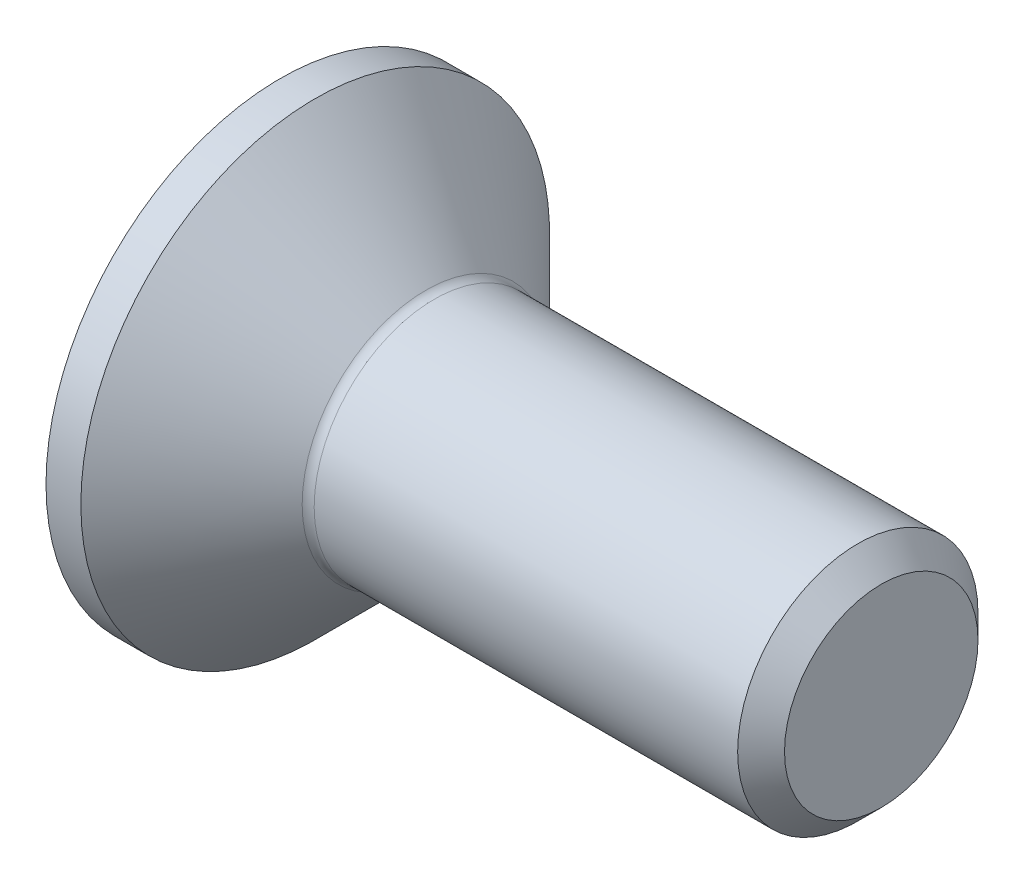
ISO-10303-21;
HEADER;
FILE_DESCRIPTION(('STEP AP214'),'2;1');
FILE_NAME('part.step','',(''),(''),'','','');
FILE_SCHEMA(('AUTOMOTIVE_DESIGN { 1 0 10303 214 1 1 1 1 }'));
ENDSEC;
DATA;
#1=APPLICATION_CONTEXT('core data for automotive mechanical design processes');
#2=APPLICATION_PROTOCOL_DEFINITION('international standard','automotive_design',2000,#1);
#3=PRODUCT_CONTEXT('',#1,'mechanical');
#4=PRODUCT('Part','Part','',(#3));
#5=PRODUCT_RELATED_PRODUCT_CATEGORY('part','',(#4));
#6=PRODUCT_DEFINITION_FORMATION('','',#4);
#7=PRODUCT_DEFINITION_CONTEXT('part definition',#1,'design');
#8=PRODUCT_DEFINITION('design','',#6,#7);
#9=PRODUCT_DEFINITION_SHAPE('','',#8);
#10=(LENGTH_UNIT() NAMED_UNIT(*) SI_UNIT(.MILLI.,.METRE.));
#11=(NAMED_UNIT(*) PLANE_ANGLE_UNIT() SI_UNIT($,.RADIAN.));
#12=(NAMED_UNIT(*) SI_UNIT($,.STERADIAN.) SOLID_ANGLE_UNIT());
#13=UNCERTAINTY_MEASURE_WITH_UNIT(LENGTH_MEASURE(1.E-05),#10,'distance_accuracy_value','');
#14=(GEOMETRIC_REPRESENTATION_CONTEXT(3) GLOBAL_UNCERTAINTY_ASSIGNED_CONTEXT((#13)) GLOBAL_UNIT_ASSIGNED_CONTEXT((#10,
#11,#12)) REPRESENTATION_CONTEXT('',''));
#15=CARTESIAN_POINT('',(0.,0.,0.));
#16=DIRECTION('',(0.,0.,1.));
#17=DIRECTION('',(1.,0.,0.));
#18=AXIS2_PLACEMENT_3D('',#15,#16,#17);
#19=CARTESIAN_POINT('',(0.,0.,0.));
#20=DIRECTION('',(-1.,0.,0.));
#21=DIRECTION('',(0.,0.,1.));
#22=AXIS2_PLACEMENT_3D('',#19,#20,#21);
#23=PLANE('',#22);
#24=CARTESIAN_POINT('',(0.,0.,0.));
#25=DIRECTION('',(-1.,0.,0.));
#26=DIRECTION('',(0.,0.,1.));
#27=AXIS2_PLACEMENT_3D('',#24,#25,#26);
#28=CIRCLE('',#27,3.9);
#29=CARTESIAN_POINT('',(0.,0.,3.9));
#30=VERTEX_POINT('',#29);
#31=EDGE_CURVE('E155',#30,#30,#28,.T.);
#32=ORIENTED_EDGE('',*,*,#31,.T.);
#33=EDGE_LOOP('',(#32));
#34=FACE_BOUND('',#33,.T.);
#35=DIRECTION('',(0.,-0.5,-0.866025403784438));
#36=VECTOR('',#35,1.);
#37=CARTESIAN_POINT('',(0.,-0.721687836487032,1.25));
#38=LINE('',#37,#36);
#39=CARTESIAN_POINT('',(0.,-0.721687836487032,1.25));
#40=VERTEX_POINT('',#39);
#41=CARTESIAN_POINT('',(0.,-1.44337567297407,0.));
#42=VERTEX_POINT('',#41);
#43=EDGE_CURVE('E117',#40,#42,#38,.T.);
#44=ORIENTED_EDGE('',*,*,#43,.T.);
#45=DIRECTION('',(0.,0.5,-0.866025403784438));
#46=VECTOR('',#45,1.);
#47=CARTESIAN_POINT('',(0.,-1.44337567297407,0.));
#48=LINE('',#47,#46);
#49=CARTESIAN_POINT('',(0.,-0.721687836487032,-1.25));
#50=VERTEX_POINT('',#49);
#51=EDGE_CURVE('E47',#42,#50,#48,.T.);
#52=ORIENTED_EDGE('',*,*,#51,.T.);
#53=DIRECTION('',(0.,1.,0.));
#54=VECTOR('',#53,1.);
#55=CARTESIAN_POINT('',(0.,-0.721687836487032,-1.25));
#56=LINE('',#55,#54);
#57=CARTESIAN_POINT('',(0.,0.721687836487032,-1.25));
#58=VERTEX_POINT('',#57);
#59=EDGE_CURVE('E132',#50,#58,#56,.T.);
#60=ORIENTED_EDGE('',*,*,#59,.T.);
#61=DIRECTION('',(0.,0.5,0.866025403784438));
#62=VECTOR('',#61,1.);
#63=CARTESIAN_POINT('',(0.,0.721687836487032,-1.25));
#64=LINE('',#63,#62);
#65=CARTESIAN_POINT('',(0.,1.44337567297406,0.));
#66=VERTEX_POINT('',#65);
#67=EDGE_CURVE('E268',#58,#66,#64,.T.);
#68=ORIENTED_EDGE('',*,*,#67,.T.);
#69=DIRECTION('',(0.,-0.5,0.866025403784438));
#70=VECTOR('',#69,1.);
#71=CARTESIAN_POINT('',(0.,1.44337567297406,0.));
#72=LINE('',#71,#70);
#73=CARTESIAN_POINT('',(0.,0.721687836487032,1.25));
#74=VERTEX_POINT('',#73);
#75=EDGE_CURVE('E271',#66,#74,#72,.T.);
#76=ORIENTED_EDGE('',*,*,#75,.T.);
#77=DIRECTION('',(0.,-1.,0.));
#78=VECTOR('',#77,1.);
#79=CARTESIAN_POINT('',(0.,0.721687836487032,1.25));
#80=LINE('',#79,#78);
#81=EDGE_CURVE('E274',#74,#40,#80,.T.);
#82=ORIENTED_EDGE('',*,*,#81,.T.);
#83=EDGE_LOOP('',(#44,#52,#60,#68,#76,#82));
#84=FACE_BOUND('',#83,.T.);
#85=ADVANCED_FACE('F32',(#34,#84),#23,.T.);
#86=CARTESIAN_POINT('',(0.,0.,0.));
#87=DIRECTION('',(-1.,0.,0.));
#88=DIRECTION('',(0.,0.,1.));
#89=AXIS2_PLACEMENT_3D('',#86,#87,#88);
#90=CYLINDRICAL_SURFACE('',#89,3.9);
#91=CARTESIAN_POINT('',(0.580000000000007,0.,0.));
#92=DIRECTION('',(-1.,0.,0.));
#93=DIRECTION('',(0.,0.,1.));
#94=AXIS2_PLACEMENT_3D('',#91,#92,#93);
#95=CIRCLE('',#94,3.9);
#96=CARTESIAN_POINT('',(0.580000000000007,0.,3.9));
#97=VERTEX_POINT('',#96);
#98=EDGE_CURVE('E152',#97,#97,#95,.T.);
#99=ORIENTED_EDGE('',*,*,#98,.T.);
#100=EDGE_LOOP('',(#99));
#101=FACE_BOUND('',#100,.T.);
#102=ORIENTED_EDGE('',*,*,#31,.F.);
#103=EDGE_LOOP('',(#102));
#104=FACE_BOUND('',#103,.T.);
#105=ADVANCED_FACE('F176',(#101,#104),#90,.T.);
#106=CARTESIAN_POINT('',(0.580000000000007,0.,0.));
#107=DIRECTION('',(-1.,0.,0.));
#108=DIRECTION('',(0.,0.,1.));
#109=AXIS2_PLACEMENT_3D('',#106,#107,#108);
#110=CONICAL_SURFACE('',#109,3.9,0.78539816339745);
#111=CARTESIAN_POINT('',(2.42142135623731,0.,0.));
#112=DIRECTION('',(-1.,0.,0.));
#113=DIRECTION('',(0.,0.,1.));
#114=AXIS2_PLACEMENT_3D('',#111,#112,#113);
#115=CIRCLE('',#114,2.05857864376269);
#116=CARTESIAN_POINT('',(2.42142135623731,0.,2.05857864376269));
#117=VERTEX_POINT('',#116);
#118=EDGE_CURVE('E40',#117,#117,#115,.T.);
#119=ORIENTED_EDGE('',*,*,#118,.T.);
#120=EDGE_LOOP('',(#119));
#121=FACE_BOUND('',#120,.T.);
#122=ORIENTED_EDGE('',*,*,#98,.F.);
#123=EDGE_LOOP('',(#122));
#124=FACE_BOUND('',#123,.T.);
#125=ADVANCED_FACE('F160',(#121,#124),#110,.T.);
#126=CARTESIAN_POINT('',(0.,0.,0.));
#127=DIRECTION('',(-1.,0.,0.));
#128=DIRECTION('',(0.,0.,1.));
#129=AXIS2_PLACEMENT_3D('',#126,#127,#128);
#130=CYLINDRICAL_SURFACE('',#129,1.99999999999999);
#131=CARTESIAN_POINT('',(2.56284271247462,0.,0.));
#132=DIRECTION('',(-1.,0.,0.));
#133=DIRECTION('',(0.,0.,1.));
#134=AXIS2_PLACEMENT_3D('',#131,#132,#133);
#135=CIRCLE('',#134,1.99999999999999);
#136=CARTESIAN_POINT('',(2.56284271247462,0.,1.99999999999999));
#137=VERTEX_POINT('',#136);
#138=EDGE_CURVE('E11',#137,#137,#135,.F.);
#139=ORIENTED_EDGE('',*,*,#138,.T.);
#140=EDGE_LOOP('',(#139));
#141=FACE_BOUND('',#140,.T.);
#142=CARTESIAN_POINT('',(9.61,0.,0.));
#143=DIRECTION('',(-1.,0.,0.));
#144=DIRECTION('',(0.,0.,1.));
#145=AXIS2_PLACEMENT_3D('',#142,#143,#144);
#146=CIRCLE('',#145,1.99999999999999);
#147=CARTESIAN_POINT('',(9.61,0.,1.99999999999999));
#148=VERTEX_POINT('',#147);
#149=EDGE_CURVE('E149',#148,#148,#146,.T.);
#150=ORIENTED_EDGE('',*,*,#149,.T.);
#151=EDGE_LOOP('',(#150));
#152=FACE_BOUND('',#151,.T.);
#153=ADVANCED_FACE('F187',(#141,#152),#130,.T.);
#154=CARTESIAN_POINT('',(10.,0.,0.));
#155=DIRECTION('',(-1.,0.,0.));
#156=DIRECTION('',(0.,0.,1.));
#157=AXIS2_PLACEMENT_3D('',#154,#155,#156);
#158=CONICAL_SURFACE('',#157,1.61,0.785398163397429);
#159=ORIENTED_EDGE('',*,*,#149,.F.);
#160=EDGE_LOOP('',(#159));
#161=FACE_BOUND('',#160,.T.);
#162=CARTESIAN_POINT('',(10.,0.,0.));
#163=DIRECTION('',(-1.,0.,0.));
#164=DIRECTION('',(0.,0.,1.));
#165=AXIS2_PLACEMENT_3D('',#162,#163,#164);
#166=CIRCLE('',#165,1.61);
#167=CARTESIAN_POINT('',(10.,0.,1.61));
#168=VERTEX_POINT('',#167);
#169=EDGE_CURVE('E145',#168,#168,#166,.T.);
#170=ORIENTED_EDGE('',*,*,#169,.T.);
#171=EDGE_LOOP('',(#170));
#172=FACE_BOUND('',#171,.T.);
#173=ADVANCED_FACE('F171',(#161,#172),#158,.T.);
#174=CARTESIAN_POINT('',(10.,1.61,0.));
#175=DIRECTION('',(1.,0.,0.));
#176=DIRECTION('',(0.,0.,-1.));
#177=AXIS2_PLACEMENT_3D('',#174,#175,#176);
#178=PLANE('',#177);
#179=ORIENTED_EDGE('',*,*,#169,.F.);
#180=EDGE_LOOP('',(#179));
#181=FACE_BOUND('',#180,.T.);
#182=ADVANCED_FACE('F164',(#181),#178,.T.);
#183=CARTESIAN_POINT('',(2.56284271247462,0.,0.));
#184=DIRECTION('',(-1.,0.,0.));
#185=DIRECTION('',(0.,0.,1.));
#186=AXIS2_PLACEMENT_3D('',#183,#184,#185);
#187=TOROIDAL_SURFACE('',#186,2.19999999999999,0.2);
#188=ORIENTED_EDGE('',*,*,#138,.F.);
#189=EDGE_LOOP('',(#188));
#190=FACE_BOUND('',#189,.T.);
#191=ORIENTED_EDGE('',*,*,#118,.F.);
#192=EDGE_LOOP('',(#191));
#193=FACE_BOUND('',#192,.T.);
#194=ADVANCED_FACE('F34',(#190,#193),#187,.F.);
#195=CARTESIAN_POINT('',(1.5,-1.44337567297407,0.));
#196=DIRECTION('',(0.,0.866025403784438,0.5));
#197=DIRECTION('',(0.,-0.5,0.866025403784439));
#198=AXIS2_PLACEMENT_3D('',#195,#196,#197);
#199=PLANE('',#198);
#200=ORIENTED_EDGE('',*,*,#51,.F.);
#201=DIRECTION('',(-1.,0.,0.));
#202=VECTOR('',#201,1.);
#203=CARTESIAN_POINT('',(1.5,-1.44337567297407,0.));
#204=LINE('',#203,#202);
#205=CARTESIAN_POINT('',(1.5,-1.44337567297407,0.));
#206=VERTEX_POINT('',#205);
#207=EDGE_CURVE('E265',#206,#42,#204,.T.);
#208=ORIENTED_EDGE('',*,*,#207,.F.);
#209=DIRECTION('',(0.,0.5,-0.866025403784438));
#210=VECTOR('',#209,1.);
#211=CARTESIAN_POINT('',(1.5,-1.44337567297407,0.));
#212=LINE('',#211,#210);
#213=CARTESIAN_POINT('',(1.5,-1.08253175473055,-0.625000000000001));
#214=VERTEX_POINT('',#213);
#215=EDGE_CURVE('E114',#206,#214,#212,.T.);
#216=ORIENTED_EDGE('',*,*,#215,.T.);
#217=CARTESIAN_POINT('',(1.5,-0.721687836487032,-1.25));
#218=VERTEX_POINT('',#217);
#219=EDGE_CURVE('E108',#214,#218,#212,.T.);
#220=ORIENTED_EDGE('',*,*,#219,.T.);
#221=DIRECTION('',(-1.,0.,0.));
#222=VECTOR('',#221,1.);
#223=CARTESIAN_POINT('',(1.5,-0.721687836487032,-1.25));
#224=LINE('',#223,#222);
#225=EDGE_CURVE('E112',#218,#50,#224,.T.);
#226=ORIENTED_EDGE('',*,*,#225,.T.);
#227=EDGE_LOOP('',(#200,#208,#216,#220,#226));
#228=FACE_BOUND('',#227,.T.);
#229=ADVANCED_FACE('F110',(#228),#199,.T.);
#230=CARTESIAN_POINT('',(1.5,-0.721687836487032,-1.25));
#231=DIRECTION('',(0.,0.,1.));
#232=DIRECTION('',(0.,-1.,0.));
#233=AXIS2_PLACEMENT_3D('',#230,#231,#232);
#234=PLANE('',#233);
#235=ORIENTED_EDGE('',*,*,#59,.F.);
#236=ORIENTED_EDGE('',*,*,#225,.F.);
#237=DIRECTION('',(0.,1.,0.));
#238=VECTOR('',#237,1.);
#239=CARTESIAN_POINT('',(1.5,-0.721687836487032,-1.25));
#240=LINE('',#239,#238);
#241=CARTESIAN_POINT('',(1.5,0.,-1.25));
#242=VERTEX_POINT('',#241);
#243=EDGE_CURVE('E120',#218,#242,#240,.T.);
#244=ORIENTED_EDGE('',*,*,#243,.T.);
#245=CARTESIAN_POINT('',(1.5,0.721687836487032,-1.25));
#246=VERTEX_POINT('',#245);
#247=EDGE_CURVE('E127',#242,#246,#240,.T.);
#248=ORIENTED_EDGE('',*,*,#247,.T.);
#249=DIRECTION('',(-1.,0.,0.));
#250=VECTOR('',#249,1.);
#251=CARTESIAN_POINT('',(1.5,0.721687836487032,-1.25));
#252=LINE('',#251,#250);
#253=EDGE_CURVE('E134',#246,#58,#252,.T.);
#254=ORIENTED_EDGE('',*,*,#253,.T.);
#255=EDGE_LOOP('',(#235,#236,#244,#248,#254));
#256=FACE_BOUND('',#255,.T.);
#257=ADVANCED_FACE('F129',(#256),#234,.T.);
#258=CARTESIAN_POINT('',(1.5,0.721687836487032,-1.25));
#259=DIRECTION('',(0.,-0.866025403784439,0.5));
#260=DIRECTION('',(0.,-0.5,-0.866025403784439));
#261=AXIS2_PLACEMENT_3D('',#258,#259,#260);
#262=PLANE('',#261);
#263=ORIENTED_EDGE('',*,*,#67,.F.);
#264=ORIENTED_EDGE('',*,*,#253,.F.);
#265=DIRECTION('',(0.,0.5,0.866025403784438));
#266=VECTOR('',#265,1.);
#267=CARTESIAN_POINT('',(1.5,0.721687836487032,-1.25));
#268=LINE('',#267,#266);
#269=CARTESIAN_POINT('',(1.5,1.08253175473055,-0.625));
#270=VERTEX_POINT('',#269);
#271=EDGE_CURVE('E257',#246,#270,#268,.T.);
#272=ORIENTED_EDGE('',*,*,#271,.T.);
#273=CARTESIAN_POINT('',(1.5,1.44337567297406,0.));
#274=VERTEX_POINT('',#273);
#275=EDGE_CURVE('E126',#270,#274,#268,.T.);
#276=ORIENTED_EDGE('',*,*,#275,.T.);
#277=DIRECTION('',(-1.,0.,0.));
#278=VECTOR('',#277,1.);
#279=CARTESIAN_POINT('',(1.5,1.44337567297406,0.));
#280=LINE('',#279,#278);
#281=EDGE_CURVE('E140',#274,#66,#280,.T.);
#282=ORIENTED_EDGE('',*,*,#281,.T.);
#283=EDGE_LOOP('',(#263,#264,#272,#276,#282));
#284=FACE_BOUND('',#283,.T.);
#285=ADVANCED_FACE('F201',(#284),#262,.T.);
#286=CARTESIAN_POINT('',(1.5,1.44337567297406,0.));
#287=DIRECTION('',(0.,-0.866025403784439,-0.5));
#288=DIRECTION('',(0.,0.5,-0.866025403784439));
#289=AXIS2_PLACEMENT_3D('',#286,#287,#288);
#290=PLANE('',#289);
#291=ORIENTED_EDGE('',*,*,#75,.F.);
#292=ORIENTED_EDGE('',*,*,#281,.F.);
#293=DIRECTION('',(0.,-0.5,0.866025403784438));
#294=VECTOR('',#293,1.);
#295=CARTESIAN_POINT('',(1.5,1.44337567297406,0.));
#296=LINE('',#295,#294);
#297=CARTESIAN_POINT('',(1.5,1.08253175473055,0.625));
#298=VERTEX_POINT('',#297);
#299=EDGE_CURVE('E55',#274,#298,#296,.T.);
#300=ORIENTED_EDGE('',*,*,#299,.T.);
#301=CARTESIAN_POINT('',(1.5,0.721687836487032,1.25));
#302=VERTEX_POINT('',#301);
#303=EDGE_CURVE('E236',#298,#302,#296,.T.);
#304=ORIENTED_EDGE('',*,*,#303,.T.);
#305=DIRECTION('',(-1.,0.,0.));
#306=VECTOR('',#305,1.);
#307=CARTESIAN_POINT('',(1.5,0.721687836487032,1.25));
#308=LINE('',#307,#306);
#309=EDGE_CURVE('E250',#302,#74,#308,.T.);
#310=ORIENTED_EDGE('',*,*,#309,.T.);
#311=EDGE_LOOP('',(#291,#292,#300,#304,#310));
#312=FACE_BOUND('',#311,.T.);
#313=ADVANCED_FACE('F204',(#312),#290,.T.);
#314=CARTESIAN_POINT('',(1.5,0.721687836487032,1.25));
#315=DIRECTION('',(0.,0.,-1.));
#316=DIRECTION('',(0.,1.,0.));
#317=AXIS2_PLACEMENT_3D('',#314,#315,#316);
#318=PLANE('',#317);
#319=ORIENTED_EDGE('',*,*,#81,.F.);
#320=ORIENTED_EDGE('',*,*,#309,.F.);
#321=DIRECTION('',(0.,-1.,0.));
#322=VECTOR('',#321,1.);
#323=CARTESIAN_POINT('',(1.5,0.721687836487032,1.25));
#324=LINE('',#323,#322);
#325=CARTESIAN_POINT('',(1.5,0.,1.25));
#326=VERTEX_POINT('',#325);
#327=EDGE_CURVE('E235',#302,#326,#324,.T.);
#328=ORIENTED_EDGE('',*,*,#327,.T.);
#329=CARTESIAN_POINT('',(1.5,-0.721687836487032,1.25));
#330=VERTEX_POINT('',#329);
#331=EDGE_CURVE('E241',#326,#330,#324,.T.);
#332=ORIENTED_EDGE('',*,*,#331,.T.);
#333=DIRECTION('',(-1.,0.,0.));
#334=VECTOR('',#333,1.);
#335=CARTESIAN_POINT('',(1.5,-0.721687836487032,1.25));
#336=LINE('',#335,#334);
#337=EDGE_CURVE('E280',#330,#40,#336,.T.);
#338=ORIENTED_EDGE('',*,*,#337,.T.);
#339=EDGE_LOOP('',(#319,#320,#328,#332,#338));
#340=FACE_BOUND('',#339,.T.);
#341=ADVANCED_FACE('F208',(#340),#318,.T.);
#342=CARTESIAN_POINT('',(1.5,-0.721687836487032,1.25));
#343=DIRECTION('',(0.,0.866025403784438,-0.5));
#344=DIRECTION('',(0.,0.5,0.866025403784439));
#345=AXIS2_PLACEMENT_3D('',#342,#343,#344);
#346=PLANE('',#345);
#347=ORIENTED_EDGE('',*,*,#43,.F.);
#348=ORIENTED_EDGE('',*,*,#337,.F.);
#349=DIRECTION('',(0.,-0.5,-0.866025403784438));
#350=VECTOR('',#349,1.);
#351=CARTESIAN_POINT('',(1.5,-0.721687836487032,1.25));
#352=LINE('',#351,#350);
#353=CARTESIAN_POINT('',(1.5,-1.08253175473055,0.625000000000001));
#354=VERTEX_POINT('',#353);
#355=EDGE_CURVE('E244',#330,#354,#352,.T.);
#356=ORIENTED_EDGE('',*,*,#355,.T.);
#357=EDGE_CURVE('E251',#354,#206,#352,.T.);
#358=ORIENTED_EDGE('',*,*,#357,.T.);
#359=ORIENTED_EDGE('',*,*,#207,.T.);
#360=EDGE_LOOP('',(#347,#348,#356,#358,#359));
#361=FACE_BOUND('',#360,.T.);
#362=ADVANCED_FACE('F211',(#361),#346,.T.);
#363=CARTESIAN_POINT('',(1.5,-1.44337567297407,0.));
#364=DIRECTION('',(-1.,0.,0.));
#365=DIRECTION('',(0.,0.,1.));
#366=AXIS2_PLACEMENT_3D('',#363,#364,#365);
#367=PLANE('',#366);
#368=CARTESIAN_POINT('',(1.5,0.,0.));
#369=DIRECTION('',(-1.,0.,0.));
#370=DIRECTION('',(0.,0.,1.));
#371=AXIS2_PLACEMENT_3D('',#368,#369,#370);
#372=CIRCLE('',#371,1.25);
#373=EDGE_CURVE('E133',#354,#326,#372,.T.);
#374=ORIENTED_EDGE('',*,*,#373,.F.);
#375=ORIENTED_EDGE('',*,*,#355,.F.);
#376=ORIENTED_EDGE('',*,*,#331,.F.);
#377=EDGE_LOOP('',(#374,#375,#376));
#378=FACE_BOUND('',#377,.T.);
#379=ADVANCED_FACE('F215',(#378),#367,.T.);
#380=EDGE_CURVE('E137',#214,#354,#372,.T.);
#381=ORIENTED_EDGE('',*,*,#380,.F.);
#382=ORIENTED_EDGE('',*,*,#215,.F.);
#383=ORIENTED_EDGE('',*,*,#357,.F.);
#384=EDGE_LOOP('',(#381,#382,#383));
#385=FACE_BOUND('',#384,.T.);
#386=ADVANCED_FACE('F218',(#385),#367,.T.);
#387=EDGE_CURVE('E122',#242,#214,#372,.T.);
#388=ORIENTED_EDGE('',*,*,#387,.F.);
#389=ORIENTED_EDGE('',*,*,#243,.F.);
#390=ORIENTED_EDGE('',*,*,#219,.F.);
#391=EDGE_LOOP('',(#388,#389,#390));
#392=FACE_BOUND('',#391,.T.);
#393=ADVANCED_FACE('F121',(#392),#367,.T.);
#394=EDGE_CURVE('E253',#270,#242,#372,.T.);
#395=ORIENTED_EDGE('',*,*,#394,.F.);
#396=ORIENTED_EDGE('',*,*,#271,.F.);
#397=ORIENTED_EDGE('',*,*,#247,.F.);
#398=EDGE_LOOP('',(#395,#396,#397));
#399=FACE_BOUND('',#398,.T.);
#400=ADVANCED_FACE('F230',(#399),#367,.T.);
#401=EDGE_CURVE('E146',#298,#270,#372,.T.);
#402=ORIENTED_EDGE('',*,*,#401,.F.);
#403=ORIENTED_EDGE('',*,*,#299,.F.);
#404=ORIENTED_EDGE('',*,*,#275,.F.);
#405=EDGE_LOOP('',(#402,#403,#404));
#406=FACE_BOUND('',#405,.T.);
#407=ADVANCED_FACE('F225',(#406),#367,.T.);
#408=EDGE_CURVE('E139',#326,#298,#372,.T.);
#409=ORIENTED_EDGE('',*,*,#408,.F.);
#410=ORIENTED_EDGE('',*,*,#327,.F.);
#411=ORIENTED_EDGE('',*,*,#303,.F.);
#412=EDGE_LOOP('',(#409,#410,#411));
#413=FACE_BOUND('',#412,.T.);
#414=ADVANCED_FACE('F196',(#413),#367,.T.);
#415=CARTESIAN_POINT('',(1.5,0.,0.));
#416=DIRECTION('',(-1.,0.,0.));
#417=DIRECTION('',(0.,0.,1.));
#418=AXIS2_PLACEMENT_3D('',#415,#416,#417);
#419=CONICAL_SURFACE('',#418,1.25,1.04719755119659);
#420=CARTESIAN_POINT('',(2.22168783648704,0.,0.));
#421=VERTEX_POINT('',#420);
#422=VERTEX_LOOP('',#421);
#423=FACE_BOUND('',#422,.T.);
#424=ORIENTED_EDGE('',*,*,#408,.T.);
#425=ORIENTED_EDGE('',*,*,#401,.T.);
#426=ORIENTED_EDGE('',*,*,#394,.T.);
#427=ORIENTED_EDGE('',*,*,#387,.T.);
#428=ORIENTED_EDGE('',*,*,#380,.T.);
#429=ORIENTED_EDGE('',*,*,#373,.T.);
#430=EDGE_LOOP('',(#424,#425,#426,#427,#428,#429));
#431=FACE_BOUND('',#430,.T.);
#432=ADVANCED_FACE('F194',(#423,#431),#419,.F.);
#433=CLOSED_SHELL('',(#85,#105,#125,#153,#173,#182,#194,#229,#257,#285,#313,#341,#362,#379,#386,
#393,#400,#407,#414,#432));
#434=MANIFOLD_SOLID_BREP('B2',#433);
#435=ADVANCED_BREP_SHAPE_REPRESENTATION('',(#18,#434),#14);
#436=SHAPE_DEFINITION_REPRESENTATION(#9,#435);
ENDSEC;
END-ISO-10303-21;
